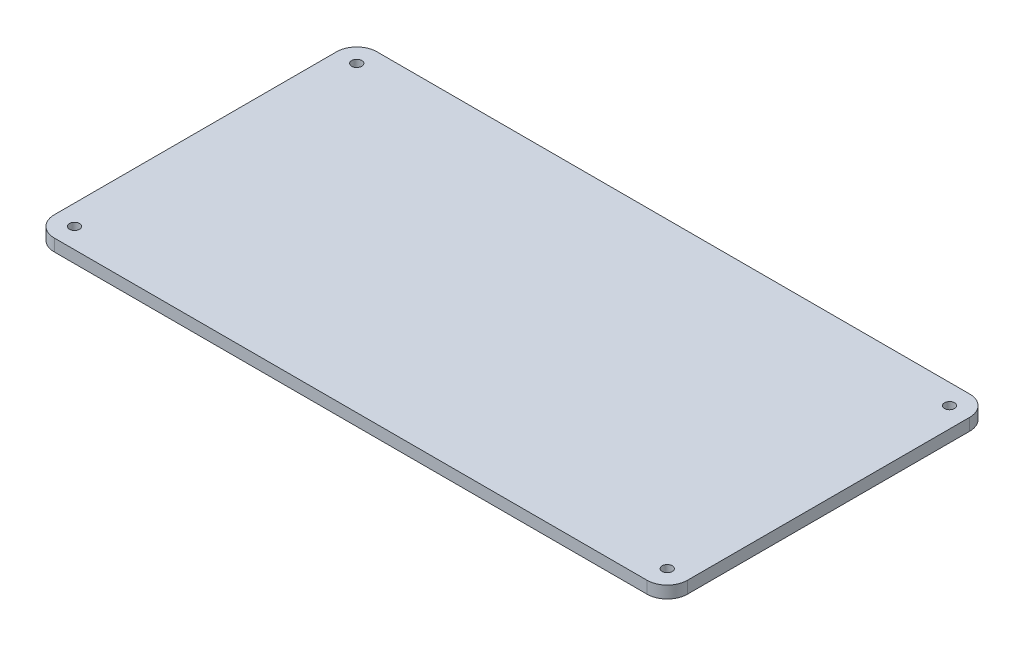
from build123d import *

# Parameters (mm, degrees)
BOSS_EXTRUDE1_DEPTH = 3
FILLET1_R           = 5
SKETCH2_R           = 1.25
CUT_EXTRUDE1_DEPTH  = 10


with BuildPart() as part:
    # Sketch1 → Boss-Extrude1 (new body)
    with BuildSketch(Plane(origin=(0, 0, 0), x_dir=(1, 0, 0), z_dir=(0, 1, 0))):
        Polygon((0, -30), (0, 30), (0, 40), (77, 40), (157, 40), (157, -40), (77, -40), (0, -40), align=None)
    extrude(amount=BOSS_EXTRUDE1_DEPTH)

    # Fillet1
    fillet1_edges = [part.edges().sort_by_distance(p)[0] for p in [
        (157, 1.5, 40),
        (0, 1.5, 40),
        (0, 1.5, -40),
        (157, 1.5, -40),
    ]]
    fillet(fillet1_edges, radius=FILLET1_R)

    # Sketch2 → Cut-Extrude1 (cut)
    with BuildSketch(Plane(origin=(0, 3, 0), x_dir=(1, 0, 0), z_dir=(0, 1, 0))):
        with Locations(Location((5, 35, 0), (0, 0, 270))):
            Circle(SKETCH2_R)
        with Locations(Location((152, 35, 0), (0, 0, 270))):
            Circle(SKETCH2_R)
        with Locations(Location((152, -35, 0), (0, 0, 270))):
            Circle(SKETCH2_R)
        with Locations(Location((5, -35, 0), (0, 0, 270))):
            Circle(SKETCH2_R)
    extrude(amount=-CUT_EXTRUDE1_DEPTH, mode=Mode.SUBTRACT)


solid = part.part
